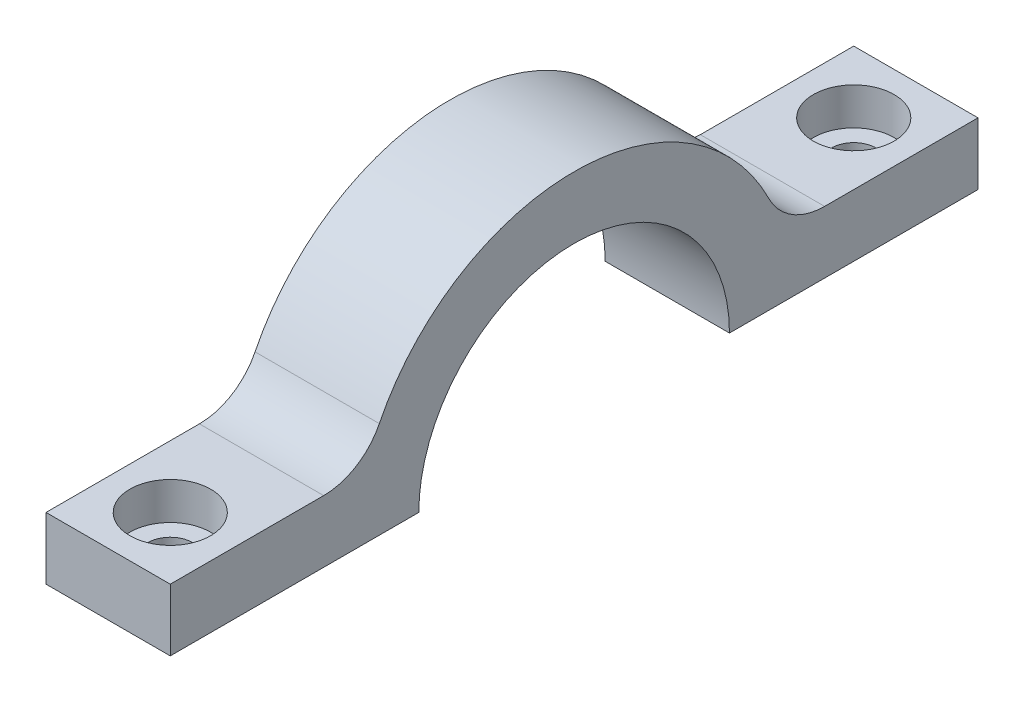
from build123d import *

# Parameters (mm, degrees)
BOSS_EXTRUDE1_DEPTH            = 5
CBORE_FOR_M3_SHCS1_D           = 3.6
CBORE_FOR_M3_SHCS1_DEPTH       = 5
CBORE_FOR_M3_SHCS1_CBORE_D     = 6.5
CBORE_FOR_M3_SHCS1_CBORE_DEPTH = 3
CBORE_FOR_M3_SHCS1_TIP         = 1.081549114
FILLET1_R                      = 5


with BuildPart() as part:
    # Sketch1 → Boss-Extrude1 (new, symmetric)
    with BuildSketch(Plane(origin=(0, 0, 0), x_dir=(0, 0, -1), z_dir=(1, 0, 0))):
        with BuildLine():
            Line((-32.5, 0), (-12.5, 0))
            ThreePointArc((-12.5, 0), (0, 12.5), (12.5, 0))
            Line((12.5, 0), (32.5, 0))
            Line((32.5, 0), (32.5, 5))
            Line((32.5, 5), (16.770509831, 5))
            ThreePointArc((16.770509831, 5), (0, 17.5), (-16.770509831, 5))
            Line((-16.770509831, 5), (-32.5, 5))
            Line((-32.5, 5), (-32.5, 0))
        make_face()
    extrude(amount=BOSS_EXTRUDE1_DEPTH, both=True)

    # CBORE for M3 SHCS1
    with Locations(Plane(origin=(-41.05, 5, 0), x_dir=(1, 0, 0), z_dir=(0, 1, 0))):
        with Locations((41.05, -27.5), (41.05, 27.5)):
            CounterBoreHole(CBORE_FOR_M3_SHCS1_D / 2, CBORE_FOR_M3_SHCS1_CBORE_D / 2, CBORE_FOR_M3_SHCS1_CBORE_DEPTH, depth=CBORE_FOR_M3_SHCS1_DEPTH)
            with Locations((0, 0, -(CBORE_FOR_M3_SHCS1_DEPTH + CBORE_FOR_M3_SHCS1_TIP / 2))):  # 118° drill point
                Cone(0, CBORE_FOR_M3_SHCS1_D / 2, CBORE_FOR_M3_SHCS1_TIP, mode=Mode.SUBTRACT)

    # Fillet1
    fillet1_edges = [part.edges().sort_by_distance(p)[0] for p in [
        (0, 5, 16.770509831),
        (0, 5, -16.770509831),
    ]]
    fillet(fillet1_edges, radius=FILLET1_R)


solid = part.part
